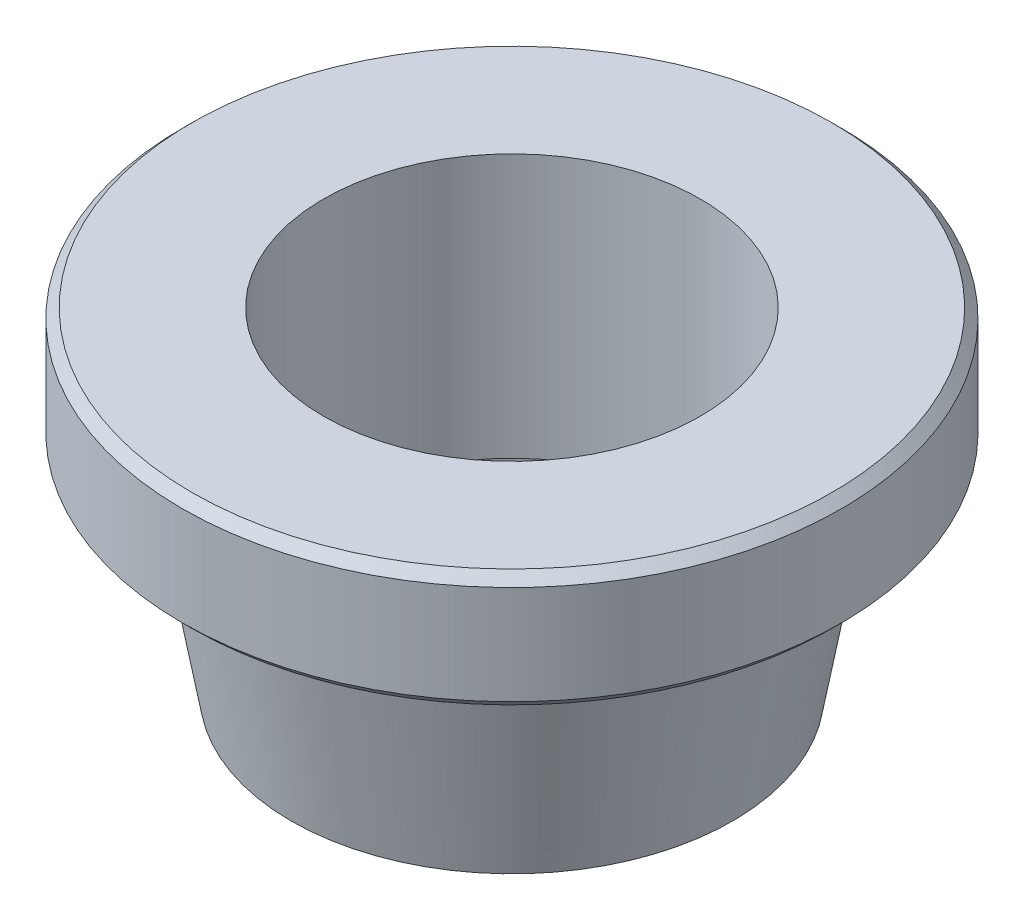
ISO-10303-21;
HEADER;
FILE_DESCRIPTION(('STEP AP214'),'2;1');
FILE_NAME('part.step','',(''),(''),'','','');
FILE_SCHEMA(('AUTOMOTIVE_DESIGN { 1 0 10303 214 1 1 1 1 }'));
ENDSEC;
DATA;
#1=APPLICATION_CONTEXT('core data for automotive mechanical design processes');
#2=APPLICATION_PROTOCOL_DEFINITION('international standard','automotive_design',2000,#1);
#3=PRODUCT_CONTEXT('',#1,'mechanical');
#4=PRODUCT('Part','Part','',(#3));
#5=PRODUCT_RELATED_PRODUCT_CATEGORY('part','',(#4));
#6=PRODUCT_DEFINITION_FORMATION('','',#4);
#7=PRODUCT_DEFINITION_CONTEXT('part definition',#1,'design');
#8=PRODUCT_DEFINITION('design','',#6,#7);
#9=PRODUCT_DEFINITION_SHAPE('','',#8);
#10=(LENGTH_UNIT() NAMED_UNIT(*) SI_UNIT(.MILLI.,.METRE.));
#11=(NAMED_UNIT(*) PLANE_ANGLE_UNIT() SI_UNIT($,.RADIAN.));
#12=(NAMED_UNIT(*) SI_UNIT($,.STERADIAN.) SOLID_ANGLE_UNIT());
#13=UNCERTAINTY_MEASURE_WITH_UNIT(LENGTH_MEASURE(1.E-05),#10,'distance_accuracy_value','');
#14=(GEOMETRIC_REPRESENTATION_CONTEXT(3) GLOBAL_UNCERTAINTY_ASSIGNED_CONTEXT((#13)) GLOBAL_UNIT_ASSIGNED_CONTEXT((#10,
#11,#12)) REPRESENTATION_CONTEXT('',''));
#15=CARTESIAN_POINT('',(0.,0.,0.));
#16=DIRECTION('',(0.,0.,1.));
#17=DIRECTION('',(1.,0.,0.));
#18=AXIS2_PLACEMENT_3D('',#15,#16,#17);
#19=CARTESIAN_POINT('',(0.,0.,0.));
#20=DIRECTION('',(0.,1.,0.));
#21=DIRECTION('',(0.,0.,1.));
#22=AXIS2_PLACEMENT_3D('',#19,#20,#21);
#23=CYLINDRICAL_SURFACE('',#22,4.);
#24=CARTESIAN_POINT('',(0.,-3.1,0.));
#25=DIRECTION('',(0.,1.,0.));
#26=DIRECTION('',(0.,0.,1.));
#27=AXIS2_PLACEMENT_3D('',#24,#25,#26);
#28=CIRCLE('',#27,4.);
#29=CARTESIAN_POINT('',(0.,-3.1,4.));
#30=VERTEX_POINT('',#29);
#31=EDGE_CURVE('E66',#30,#30,#28,.T.);
#32=ORIENTED_EDGE('',*,*,#31,.F.);
#33=EDGE_LOOP('',(#32));
#34=FACE_BOUND('',#33,.T.);
#35=CARTESIAN_POINT('',(0.,2.5,0.));
#36=DIRECTION('',(0.,1.,0.));
#37=DIRECTION('',(0.,0.,1.));
#38=AXIS2_PLACEMENT_3D('',#35,#36,#37);
#39=CIRCLE('',#38,4.);
#40=CARTESIAN_POINT('',(0.,2.5,4.));
#41=VERTEX_POINT('',#40);
#42=EDGE_CURVE('E57',#41,#41,#39,.T.);
#43=ORIENTED_EDGE('',*,*,#42,.T.);
#44=EDGE_LOOP('',(#43));
#45=FACE_BOUND('',#44,.T.);
#46=ADVANCED_FACE('F31',(#34,#45),#23,.F.);
#47=CARTESIAN_POINT('',(0.,0.,0.));
#48=DIRECTION('',(0.,1.,0.));
#49=DIRECTION('',(0.,0.,1.));
#50=AXIS2_PLACEMENT_3D('',#47,#48,#49);
#51=CONICAL_SURFACE('',#50,5.5,0.174532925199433);
#52=CARTESIAN_POINT('',(0.,-4.6,0.));
#53=DIRECTION('',(0.,1.,0.));
#54=DIRECTION('',(0.,0.,1.));
#55=AXIS2_PLACEMENT_3D('',#52,#53,#54);
#56=CIRCLE('',#55,4.68889588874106);
#57=CARTESIAN_POINT('',(0.,-4.6,4.68889588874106));
#58=VERTEX_POINT('',#57);
#59=EDGE_CURVE('E51',#58,#58,#56,.T.);
#60=ORIENTED_EDGE('',*,*,#59,.T.);
#61=EDGE_LOOP('',(#60));
#62=FACE_BOUND('',#61,.T.);
#63=CARTESIAN_POINT('',(0.,0.,0.));
#64=DIRECTION('',(0.,1.,0.));
#65=DIRECTION('',(0.,0.,1.));
#66=AXIS2_PLACEMENT_3D('',#63,#64,#65);
#67=CIRCLE('',#66,5.5);
#68=CARTESIAN_POINT('',(0.,0.,5.5));
#69=VERTEX_POINT('',#68);
#70=EDGE_CURVE('E54',#69,#69,#67,.T.);
#71=ORIENTED_EDGE('',*,*,#70,.F.);
#72=EDGE_LOOP('',(#71));
#73=FACE_BOUND('',#72,.T.);
#74=ADVANCED_FACE('F93',(#62,#73),#51,.T.);
#75=CARTESIAN_POINT('',(0.,-4.6,0.));
#76=DIRECTION('',(0.,1.,0.));
#77=DIRECTION('',(0.,0.,1.));
#78=AXIS2_PLACEMENT_3D('',#75,#76,#77);
#79=PLANE('',#78);
#80=CARTESIAN_POINT('',(0.,-4.6,0.));
#81=DIRECTION('',(0.,-1.,0.));
#82=DIRECTION('',(0.,0.,-1.));
#83=AXIS2_PLACEMENT_3D('',#80,#81,#82);
#84=CIRCLE('',#83,4.);
#85=CARTESIAN_POINT('',(0.,-4.6,-4.));
#86=VERTEX_POINT('',#85);
#87=EDGE_CURVE('E60',#86,#86,#84,.T.);
#88=ORIENTED_EDGE('',*,*,#87,.F.);
#89=EDGE_LOOP('',(#88));
#90=FACE_BOUND('',#89,.T.);
#91=ORIENTED_EDGE('',*,*,#59,.F.);
#92=EDGE_LOOP('',(#91));
#93=FACE_BOUND('',#92,.T.);
#94=ADVANCED_FACE('F108',(#90,#93),#79,.F.);
#95=CARTESIAN_POINT('',(0.,2.5,0.));
#96=DIRECTION('',(0.,-1.,0.));
#97=DIRECTION('',(0.,0.,-1.));
#98=AXIS2_PLACEMENT_3D('',#95,#96,#97);
#99=CYLINDRICAL_SURFACE('',#98,7.);
#100=CARTESIAN_POINT('',(0.,0.2,0.));
#101=DIRECTION('',(0.,1.,0.));
#102=DIRECTION('',(0.,0.,1.));
#103=AXIS2_PLACEMENT_3D('',#100,#101,#102);
#104=CIRCLE('',#103,7.);
#105=CARTESIAN_POINT('',(0.,0.2,7.));
#106=VERTEX_POINT('',#105);
#107=EDGE_CURVE('E42',#106,#106,#104,.T.);
#108=ORIENTED_EDGE('',*,*,#107,.T.);
#109=EDGE_LOOP('',(#108));
#110=FACE_BOUND('',#109,.T.);
#111=CARTESIAN_POINT('',(0.,2.29999999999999,0.));
#112=DIRECTION('',(0.,1.,0.));
#113=DIRECTION('',(0.,0.,1.));
#114=AXIS2_PLACEMENT_3D('',#111,#112,#113);
#115=CIRCLE('',#114,7.);
#116=CARTESIAN_POINT('',(0.,2.29999999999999,7.));
#117=VERTEX_POINT('',#116);
#118=EDGE_CURVE('E46',#117,#117,#115,.F.);
#119=ORIENTED_EDGE('',*,*,#118,.T.);
#120=EDGE_LOOP('',(#119));
#121=FACE_BOUND('',#120,.T.);
#122=ADVANCED_FACE('F100',(#110,#121),#99,.T.);
#123=CARTESIAN_POINT('',(0.,2.5,0.));
#124=DIRECTION('',(0.,1.,0.));
#125=DIRECTION('',(0.,0.,1.));
#126=AXIS2_PLACEMENT_3D('',#123,#124,#125);
#127=PLANE('',#126);
#128=ORIENTED_EDGE('',*,*,#42,.F.);
#129=EDGE_LOOP('',(#128));
#130=FACE_BOUND('',#129,.T.);
#131=CARTESIAN_POINT('',(0.,2.5,0.));
#132=DIRECTION('',(0.,1.,0.));
#133=DIRECTION('',(0.,0.,1.));
#134=AXIS2_PLACEMENT_3D('',#131,#132,#133);
#135=CIRCLE('',#134,6.8);
#136=CARTESIAN_POINT('',(0.,2.5,6.8));
#137=VERTEX_POINT('',#136);
#138=EDGE_CURVE('E10',#137,#137,#135,.T.);
#139=ORIENTED_EDGE('',*,*,#138,.T.);
#140=EDGE_LOOP('',(#139));
#141=FACE_BOUND('',#140,.T.);
#142=ADVANCED_FACE('F97',(#130,#141),#127,.T.);
#143=CARTESIAN_POINT('',(0.,0.,0.));
#144=DIRECTION('',(0.,1.,0.));
#145=DIRECTION('',(0.,0.,1.));
#146=AXIS2_PLACEMENT_3D('',#143,#144,#145);
#147=PLANE('',#146);
#148=CARTESIAN_POINT('',(0.,0.,0.));
#149=DIRECTION('',(0.,1.,0.));
#150=DIRECTION('',(0.,0.,1.));
#151=AXIS2_PLACEMENT_3D('',#148,#149,#150);
#152=CIRCLE('',#151,6.8);
#153=CARTESIAN_POINT('',(0.,0.,6.8));
#154=VERTEX_POINT('',#153);
#155=EDGE_CURVE('E38',#154,#154,#152,.F.);
#156=ORIENTED_EDGE('',*,*,#155,.T.);
#157=EDGE_LOOP('',(#156));
#158=FACE_BOUND('',#157,.T.);
#159=ORIENTED_EDGE('',*,*,#70,.T.);
#160=EDGE_LOOP('',(#159));
#161=FACE_BOUND('',#160,.T.);
#162=ADVANCED_FACE('F99',(#158,#161),#147,.F.);
#163=CARTESIAN_POINT('',(0.,0.2,0.));
#164=DIRECTION('',(0.,1.,0.));
#165=DIRECTION('',(0.,0.,1.));
#166=AXIS2_PLACEMENT_3D('',#163,#164,#165);
#167=CONICAL_SURFACE('',#166,7.,0.785398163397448);
#168=CARTESIAN_POINT('',(0.,0.,6.8));
#169=CARTESIAN_POINT('',(0.,0.0020833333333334,6.80208333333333));
#170=CARTESIAN_POINT('',(0.,0.00416666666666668,6.80416666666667));
#171=CARTESIAN_POINT('',(0.,0.00833333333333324,6.80833333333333));
#172=CARTESIAN_POINT('',(0.,0.0104166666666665,6.81041666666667));
#173=CARTESIAN_POINT('',(0.,0.0145833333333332,6.81458333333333));
#174=CARTESIAN_POINT('',(0.,0.0166666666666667,6.81666666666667));
#175=CARTESIAN_POINT('',(0.,0.0208333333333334,6.82083333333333));
#176=CARTESIAN_POINT('',(0.,0.0229166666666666,6.82291666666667));
#177=CARTESIAN_POINT('',(0.,0.0270833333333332,6.82708333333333));
#178=CARTESIAN_POINT('',(0.,0.0291666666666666,6.82916666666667));
#179=CARTESIAN_POINT('',(0.,0.0333333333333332,6.83333333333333));
#180=CARTESIAN_POINT('',(0.,0.0354166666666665,6.83541666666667));
#181=CARTESIAN_POINT('',(0.,0.0395833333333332,6.83958333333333));
#182=CARTESIAN_POINT('',(0.,0.0416666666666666,6.84166666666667));
#183=CARTESIAN_POINT('',(0.,0.0458333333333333,6.84583333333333));
#184=CARTESIAN_POINT('',(0.,0.0479166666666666,6.84791666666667));
#185=CARTESIAN_POINT('',(0.,0.0520833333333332,6.85208333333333));
#186=CARTESIAN_POINT('',(0.,0.0541666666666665,6.85416666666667));
#187=CARTESIAN_POINT('',(0.,0.0583333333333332,6.85833333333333));
#188=CARTESIAN_POINT('',(0.,0.0604166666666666,6.86041666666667));
#189=CARTESIAN_POINT('',(0.,0.0645833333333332,6.86458333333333));
#190=CARTESIAN_POINT('',(0.,0.0666666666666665,6.86666666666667));
#191=CARTESIAN_POINT('',(0.,0.0708333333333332,6.87083333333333));
#192=CARTESIAN_POINT('',(0.,0.0729166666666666,6.87291666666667));
#193=CARTESIAN_POINT('',(0.,0.0770833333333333,6.87708333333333));
#194=CARTESIAN_POINT('',(0.,0.0791666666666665,6.87916666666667));
#195=CARTESIAN_POINT('',(0.,0.0833333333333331,6.88333333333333));
#196=CARTESIAN_POINT('',(0.,0.0854166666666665,6.88541666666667));
#197=CARTESIAN_POINT('',(0.,0.0895833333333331,6.88958333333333));
#198=CARTESIAN_POINT('',(0.,0.0916666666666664,6.89166666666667));
#199=CARTESIAN_POINT('',(0.,0.0958333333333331,6.89583333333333));
#200=CARTESIAN_POINT('',(0.,0.0979166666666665,6.89791666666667));
#201=CARTESIAN_POINT('',(0.,0.102083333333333,6.90208333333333));
#202=CARTESIAN_POINT('',(0.,0.104166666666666,6.90416666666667));
#203=CARTESIAN_POINT('',(0.,0.108333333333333,6.90833333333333));
#204=CARTESIAN_POINT('',(0.,0.110416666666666,6.91041666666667));
#205=CARTESIAN_POINT('',(0.,0.114583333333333,6.91458333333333));
#206=CARTESIAN_POINT('',(0.,0.116666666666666,6.91666666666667));
#207=CARTESIAN_POINT('',(0.,0.120833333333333,6.92083333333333));
#208=CARTESIAN_POINT('',(0.,0.122916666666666,6.92291666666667));
#209=CARTESIAN_POINT('',(0.,0.127083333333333,6.92708333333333));
#210=CARTESIAN_POINT('',(0.,0.129166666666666,6.92916666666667));
#211=CARTESIAN_POINT('',(0.,0.133333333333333,6.93333333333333));
#212=CARTESIAN_POINT('',(0.,0.135416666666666,6.93541666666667));
#213=CARTESIAN_POINT('',(0.,0.139583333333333,6.93958333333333));
#214=CARTESIAN_POINT('',(0.,0.141666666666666,6.94166666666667));
#215=CARTESIAN_POINT('',(0.,0.145833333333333,6.94583333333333));
#216=CARTESIAN_POINT('',(0.,0.147916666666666,6.94791666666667));
#217=CARTESIAN_POINT('',(0.,0.152083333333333,6.95208333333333));
#218=CARTESIAN_POINT('',(0.,0.154166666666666,6.95416666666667));
#219=CARTESIAN_POINT('',(0.,0.158333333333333,6.95833333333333));
#220=CARTESIAN_POINT('',(0.,0.160416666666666,6.96041666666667));
#221=CARTESIAN_POINT('',(0.,0.164583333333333,6.96458333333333));
#222=CARTESIAN_POINT('',(0.,0.166666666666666,6.96666666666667));
#223=CARTESIAN_POINT('',(0.,0.170833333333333,6.97083333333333));
#224=CARTESIAN_POINT('',(0.,0.172916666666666,6.97291666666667));
#225=CARTESIAN_POINT('',(0.,0.177083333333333,6.97708333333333));
#226=CARTESIAN_POINT('',(0.,0.179166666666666,6.97916666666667));
#227=CARTESIAN_POINT('',(0.,0.183333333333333,6.98333333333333));
#228=CARTESIAN_POINT('',(0.,0.185416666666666,6.98541666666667));
#229=CARTESIAN_POINT('',(0.,0.189583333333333,6.98958333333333));
#230=CARTESIAN_POINT('',(0.,0.191666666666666,6.99166666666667));
#231=CARTESIAN_POINT('',(0.,0.195833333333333,6.99583333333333));
#232=CARTESIAN_POINT('',(0.,0.197916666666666,6.99791666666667));
#233=CARTESIAN_POINT('',(0.,0.2,7.));
#234=B_SPLINE_CURVE_WITH_KNOTS('',3,(#168,#169,#170,#171,#172,#173,#174,#175,#176,#177,#178,
#179,#180,#181,#182,#183,#184,#185,#186,#187,#188,#189,#190,#191,#192,#193,#194,#195,#196,#197,
#198,#199,#200,#201,#202,#203,#204,#205,#206,#207,#208,#209,#210,#211,#212,#213,#214,#215,#216,
#217,#218,#219,#220,#221,#222,#223,#224,#225,#226,#227,#228,#229,#230,#231,#232,#233),
.UNSPECIFIED.,.F.,.F.,(4,2,2,2,2,2,2,2,2,2,2,2,2,2,2,2,2,2,2,2,2,2,2,2,2,2,2,2,2,2,2,2,4),(0.,
0.00883883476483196,0.0176776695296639,0.0265165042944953,0.0353553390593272,0.0441941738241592,
0.0530330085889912,0.0618718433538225,0.0707106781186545,0.0795495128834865,0.0883883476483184,
0.0972271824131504,0.106066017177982,0.114904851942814,0.123743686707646,0.132582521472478,
0.141421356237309,0.150260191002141,0.159099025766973,0.167937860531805,0.176776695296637,
0.185615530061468,0.1944543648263,0.203293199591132,0.212132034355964,0.220970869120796,
0.229809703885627,0.238648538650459,0.247487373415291,0.256326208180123,0.265165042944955,
0.274003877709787,0.282842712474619),.UNSPECIFIED.);
#235=EDGE_CURVE('BSEAM106',#154,#106,#234,.T.);
#236=ORIENTED_EDGE('',*,*,#155,.F.);
#237=ORIENTED_EDGE('',*,*,#107,.F.);
#238=ORIENTED_EDGE('',*,*,#235,.T.);
#239=ORIENTED_EDGE('',*,*,#235,.F.);
#240=EDGE_LOOP('',(#236,#238,#237,#239));
#241=FACE_BOUND('',#240,.T.);
#242=ADVANCED_FACE('F106',(#241),#167,.T.);
#243=CARTESIAN_POINT('',(0.,2.5,0.));
#244=DIRECTION('',(0.,-1.,0.));
#245=DIRECTION('',(0.,0.,-1.));
#246=AXIS2_PLACEMENT_3D('',#243,#244,#245);
#247=CONICAL_SURFACE('',#246,6.8,0.785398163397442);
#248=ORIENTED_EDGE('',*,*,#118,.F.);
#249=EDGE_LOOP('',(#248));
#250=FACE_BOUND('',#249,.T.);
#251=ORIENTED_EDGE('',*,*,#138,.F.);
#252=EDGE_LOOP('',(#251));
#253=FACE_BOUND('',#252,.T.);
#254=ADVANCED_FACE('F33',(#250,#253),#247,.T.);
#255=CARTESIAN_POINT('',(0.,-3.6,0.));
#256=DIRECTION('',(0.,1.,0.));
#257=DIRECTION('',(0.,0.,1.));
#258=AXIS2_PLACEMENT_3D('',#255,#256,#257);
#259=CIRCLE('',#258,4.);
#260=CARTESIAN_POINT('',(0.,-3.6,4.));
#261=VERTEX_POINT('',#260);
#262=EDGE_CURVE('E69',#261,#261,#259,.T.);
#263=ORIENTED_EDGE('',*,*,#262,.T.);
#264=EDGE_LOOP('',(#263));
#265=FACE_BOUND('',#264,.T.);
#266=ORIENTED_EDGE('',*,*,#87,.T.);
#267=EDGE_LOOP('',(#266));
#268=FACE_BOUND('',#267,.T.);
#269=ADVANCED_FACE('F82',(#265,#268),#23,.F.);
#270=CARTESIAN_POINT('',(0.,2.5,0.));
#271=DIRECTION('',(0.,1.,0.));
#272=DIRECTION('',(0.,0.,1.));
#273=AXIS2_PLACEMENT_3D('',#270,#271,#272);
#274=CYLINDRICAL_SURFACE('',#273,4.3);
#275=CARTESIAN_POINT('',(0.,-3.6,0.));
#276=DIRECTION('',(0.,1.,0.));
#277=DIRECTION('',(0.,0.,1.));
#278=AXIS2_PLACEMENT_3D('',#275,#276,#277);
#279=CIRCLE('',#278,4.3);
#280=CARTESIAN_POINT('',(0.,-3.6,4.3));
#281=VERTEX_POINT('',#280);
#282=EDGE_CURVE('E72',#281,#281,#279,.T.);
#283=ORIENTED_EDGE('',*,*,#282,.F.);
#284=EDGE_LOOP('',(#283));
#285=FACE_BOUND('',#284,.T.);
#286=CARTESIAN_POINT('',(0.,-3.1,0.));
#287=DIRECTION('',(0.,1.,0.));
#288=DIRECTION('',(0.,0.,1.));
#289=AXIS2_PLACEMENT_3D('',#286,#287,#288);
#290=CIRCLE('',#289,4.3);
#291=CARTESIAN_POINT('',(0.,-3.1,4.3));
#292=VERTEX_POINT('',#291);
#293=EDGE_CURVE('E63',#292,#292,#290,.T.);
#294=ORIENTED_EDGE('',*,*,#293,.T.);
#295=EDGE_LOOP('',(#294));
#296=FACE_BOUND('',#295,.T.);
#297=ADVANCED_FACE('F78',(#285,#296),#274,.F.);
#298=CARTESIAN_POINT('',(-4.3,-3.1,0.));
#299=DIRECTION('',(0.,1.,0.));
#300=DIRECTION('',(0.,0.,1.));
#301=AXIS2_PLACEMENT_3D('',#298,#299,#300);
#302=PLANE('',#301);
#303=ORIENTED_EDGE('',*,*,#293,.F.);
#304=EDGE_LOOP('',(#303));
#305=FACE_BOUND('',#304,.T.);
#306=ORIENTED_EDGE('',*,*,#31,.T.);
#307=EDGE_LOOP('',(#306));
#308=FACE_BOUND('',#307,.T.);
#309=ADVANCED_FACE('F81',(#305,#308),#302,.F.);
#310=CARTESIAN_POINT('',(-4.3,-3.6,0.));
#311=DIRECTION('',(0.,-1.,0.));
#312=DIRECTION('',(0.,0.,-1.));
#313=AXIS2_PLACEMENT_3D('',#310,#311,#312);
#314=PLANE('',#313);
#315=ORIENTED_EDGE('',*,*,#262,.F.);
#316=EDGE_LOOP('',(#315));
#317=FACE_BOUND('',#316,.T.);
#318=ORIENTED_EDGE('',*,*,#282,.T.);
#319=EDGE_LOOP('',(#318));
#320=FACE_BOUND('',#319,.T.);
#321=ADVANCED_FACE('F76',(#317,#320),#314,.F.);
#322=CLOSED_SHELL('',(#46,#74,#94,#122,#142,#162,#242,#254,#269,#297,#309,#321));
#323=MANIFOLD_SOLID_BREP('B2',#322);
#324=ADVANCED_BREP_SHAPE_REPRESENTATION('',(#18,#323),#14);
#325=SHAPE_DEFINITION_REPRESENTATION(#9,#324);
ENDSEC;
END-ISO-10303-21;
